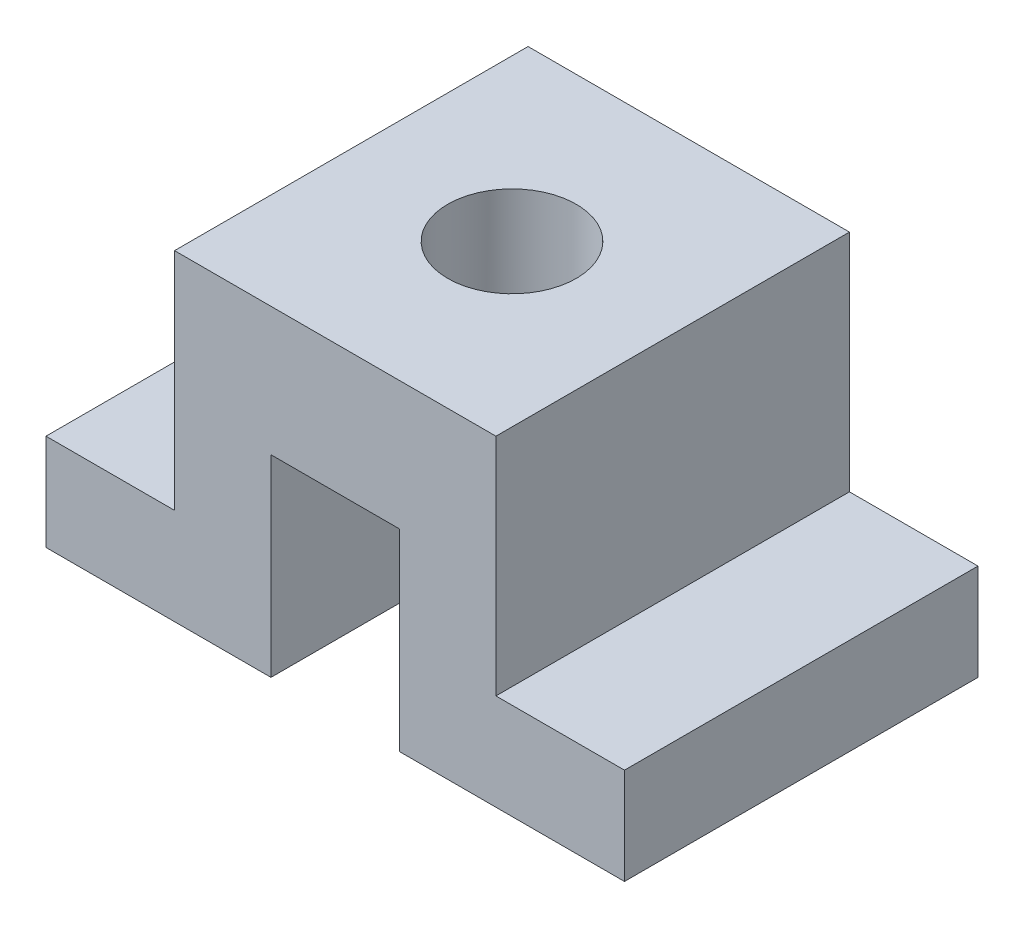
from build123d import *

# Parameters (mm, degrees)
SKETCH_1_W          = 90
SKETCH_1_H          = 55
EXTRUDE_1_DEPTH     = 50
SKETCH_3_W          = 20
SKETCH_3_H          = 35
SKETCH_3_H_2        = 30
CUT_EXTRUDE_1_DEPTH = 117.726175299
SKETCH_4_R          = 10
CUT_EXTRUDE_2_DEPTH = 117.726175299


with BuildPart() as part:
    # Sketch 1 → Extrude 1 (new body)
    with BuildSketch(Plane(origin=(0, 0, 0), x_dir=(1, 0, 0), z_dir=(0, 1, 0))):
        with Locations((45, 27.5)):
            Rectangle(SKETCH_1_W, SKETCH_1_H)
    extrude(amount=EXTRUDE_1_DEPTH)

    # Sketch 3 → Cut-Extrude 1 (cut, through all)
    with BuildSketch(Plane.XY):
        with Locations((10, 32.5)):
            Rectangle(SKETCH_3_W, SKETCH_3_H)
        with Locations((80, 32.5)):
            Rectangle(SKETCH_3_W, SKETCH_3_H)
        with Locations((45, 15)):
            Rectangle(SKETCH_3_W, SKETCH_3_H_2)
    extrude(amount=-CUT_EXTRUDE_1_DEPTH, mode=Mode.SUBTRACT)

    # Sketch 4 → Cut-Extrude 2 (cut, through all)
    with BuildSketch(Plane(origin=(0, 50, 0), x_dir=(1, 0, 0), z_dir=(0, 1, 0))):
        with Locations(Location((45, 27.5, 0), (0, 0, 270))):
            Circle(SKETCH_4_R)
    extrude(amount=-CUT_EXTRUDE_2_DEPTH, mode=Mode.SUBTRACT)


solid = part.part
